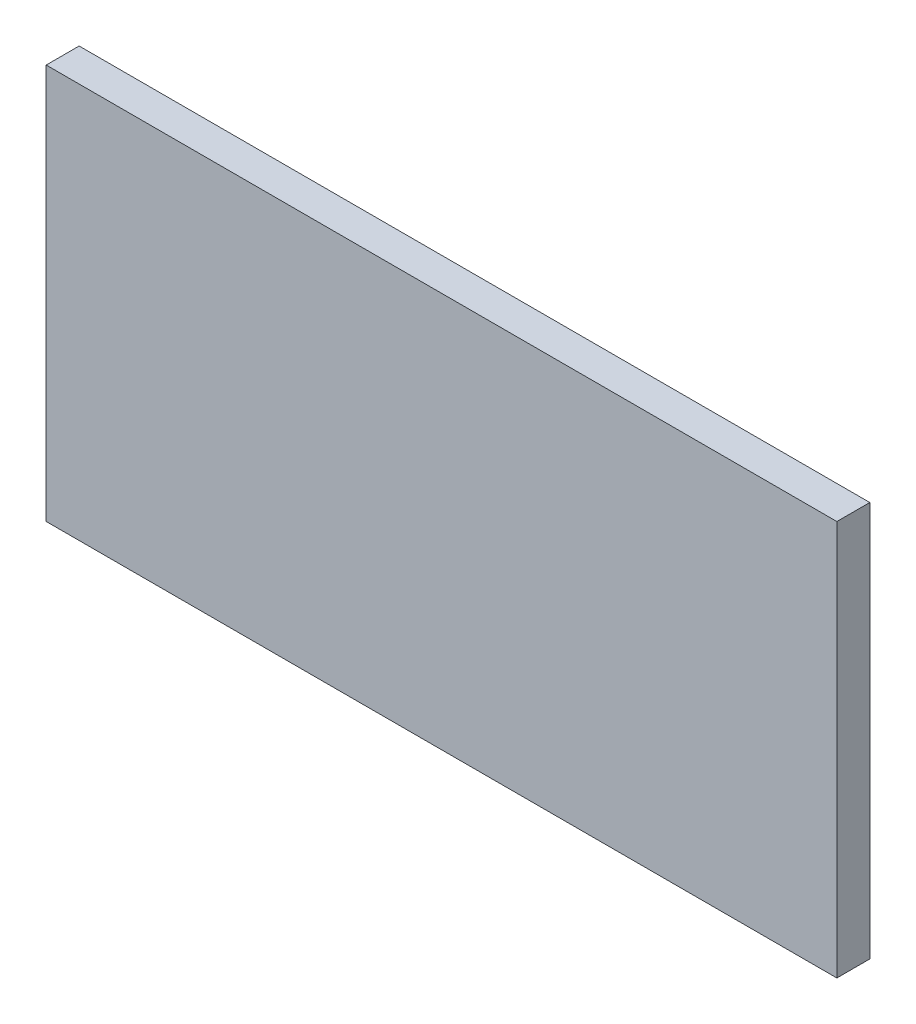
ISO-10303-21;
HEADER;
FILE_DESCRIPTION(('STEP AP214'),'2;1');
FILE_NAME('part.step','',(''),(''),'','','');
FILE_SCHEMA(('AUTOMOTIVE_DESIGN { 1 0 10303 214 1 1 1 1 }'));
ENDSEC;
DATA;
#1=APPLICATION_CONTEXT('core data for automotive mechanical design processes');
#2=APPLICATION_PROTOCOL_DEFINITION('international standard','automotive_design',2000,#1);
#3=PRODUCT_CONTEXT('',#1,'mechanical');
#4=PRODUCT('Part','Part','',(#3));
#5=PRODUCT_RELATED_PRODUCT_CATEGORY('part','',(#4));
#6=PRODUCT_DEFINITION_FORMATION('','',#4);
#7=PRODUCT_DEFINITION_CONTEXT('part definition',#1,'design');
#8=PRODUCT_DEFINITION('design','',#6,#7);
#9=PRODUCT_DEFINITION_SHAPE('','',#8);
#10=(LENGTH_UNIT() NAMED_UNIT(*) SI_UNIT(.MILLI.,.METRE.));
#11=(NAMED_UNIT(*) PLANE_ANGLE_UNIT() SI_UNIT($,.RADIAN.));
#12=(NAMED_UNIT(*) SI_UNIT($,.STERADIAN.) SOLID_ANGLE_UNIT());
#13=UNCERTAINTY_MEASURE_WITH_UNIT(LENGTH_MEASURE(1.E-05),#10,'distance_accuracy_value','');
#14=(GEOMETRIC_REPRESENTATION_CONTEXT(3) GLOBAL_UNCERTAINTY_ASSIGNED_CONTEXT((#13)) GLOBAL_UNIT_ASSIGNED_CONTEXT((#10,
#11,#12)) REPRESENTATION_CONTEXT('',''));
#15=CARTESIAN_POINT('',(0.,0.,0.));
#16=DIRECTION('',(0.,0.,1.));
#17=DIRECTION('',(1.,0.,0.));
#18=AXIS2_PLACEMENT_3D('',#15,#16,#17);
#19=CARTESIAN_POINT('',(0.,0.,5.));
#20=DIRECTION('',(1.,0.,0.));
#21=DIRECTION('',(0.,1.,0.));
#22=AXIS2_PLACEMENT_3D('',#19,#20,#21);
#23=PLANE('',#22);
#24=DIRECTION('',(0.,-1.,0.));
#25=VECTOR('',#24,1.);
#26=CARTESIAN_POINT('',(0.,0.,0.));
#27=LINE('',#26,#25);
#28=CARTESIAN_POINT('',(0.,0.,0.));
#29=VERTEX_POINT('',#28);
#30=CARTESIAN_POINT('',(0.,-60.,0.));
#31=VERTEX_POINT('',#30);
#32=EDGE_CURVE('E73',#29,#31,#27,.T.);
#33=ORIENTED_EDGE('',*,*,#32,.T.);
#34=DIRECTION('',(0.,0.,-1.));
#35=VECTOR('',#34,1.);
#36=CARTESIAN_POINT('',(0.,-60.,5.));
#37=LINE('',#36,#35);
#38=CARTESIAN_POINT('',(0.,-60.,5.));
#39=VERTEX_POINT('',#38);
#40=EDGE_CURVE('E11',#39,#31,#37,.T.);
#41=ORIENTED_EDGE('',*,*,#40,.F.);
#42=DIRECTION('',(0.,-1.,0.));
#43=VECTOR('',#42,1.);
#44=CARTESIAN_POINT('',(0.,0.,5.));
#45=LINE('',#44,#43);
#46=CARTESIAN_POINT('',(0.,0.,5.));
#47=VERTEX_POINT('',#46);
#48=EDGE_CURVE('E91',#47,#39,#45,.T.);
#49=ORIENTED_EDGE('',*,*,#48,.F.);
#50=DIRECTION('',(0.,0.,-1.));
#51=VECTOR('',#50,1.);
#52=CARTESIAN_POINT('',(0.,0.,5.));
#53=LINE('',#52,#51);
#54=EDGE_CURVE('E85',#47,#29,#53,.T.);
#55=ORIENTED_EDGE('',*,*,#54,.T.);
#56=EDGE_LOOP('',(#33,#41,#49,#55));
#57=FACE_BOUND('',#56,.T.);
#58=ADVANCED_FACE('F29',(#57),#23,.F.);
#59=CARTESIAN_POINT('',(0.,-60.,5.));
#60=DIRECTION('',(0.,1.,0.));
#61=DIRECTION('',(0.,0.,1.));
#62=AXIS2_PLACEMENT_3D('',#59,#60,#61);
#63=PLANE('',#62);
#64=DIRECTION('',(1.,0.,0.));
#65=VECTOR('',#64,1.);
#66=CARTESIAN_POINT('',(0.,-60.,0.));
#67=LINE('',#66,#65);
#68=CARTESIAN_POINT('',(120.,-60.,0.));
#69=VERTEX_POINT('',#68);
#70=EDGE_CURVE('E69',#31,#69,#67,.T.);
#71=ORIENTED_EDGE('',*,*,#70,.T.);
#72=DIRECTION('',(0.,0.,-1.));
#73=VECTOR('',#72,1.);
#74=CARTESIAN_POINT('',(120.,-60.,5.));
#75=LINE('',#74,#73);
#76=CARTESIAN_POINT('',(120.,-60.,5.));
#77=VERTEX_POINT('',#76);
#78=EDGE_CURVE('E36',#77,#69,#75,.T.);
#79=ORIENTED_EDGE('',*,*,#78,.F.);
#80=DIRECTION('',(1.,0.,0.));
#81=VECTOR('',#80,1.);
#82=CARTESIAN_POINT('',(0.,-60.,5.));
#83=LINE('',#82,#81);
#84=EDGE_CURVE('E81',#39,#77,#83,.T.);
#85=ORIENTED_EDGE('',*,*,#84,.F.);
#86=ORIENTED_EDGE('',*,*,#40,.T.);
#87=EDGE_LOOP('',(#71,#79,#85,#86));
#88=FACE_BOUND('',#87,.T.);
#89=ADVANCED_FACE('F80',(#88),#63,.F.);
#90=CARTESIAN_POINT('',(120.,0.,5.));
#91=DIRECTION('',(-1.,0.,0.));
#92=DIRECTION('',(0.,-1.,0.));
#93=AXIS2_PLACEMENT_3D('',#90,#91,#92);
#94=PLANE('',#93);
#95=DIRECTION('',(0.,1.,0.));
#96=VECTOR('',#95,1.);
#97=CARTESIAN_POINT('',(120.,0.,0.));
#98=LINE('',#97,#96);
#99=CARTESIAN_POINT('',(120.,0.,0.));
#100=VERTEX_POINT('',#99);
#101=EDGE_CURVE('E74',#69,#100,#98,.T.);
#102=ORIENTED_EDGE('',*,*,#101,.T.);
#103=DIRECTION('',(0.,0.,-1.));
#104=VECTOR('',#103,1.);
#105=CARTESIAN_POINT('',(120.,0.,5.));
#106=LINE('',#105,#104);
#107=CARTESIAN_POINT('',(120.,0.,5.));
#108=VERTEX_POINT('',#107);
#109=EDGE_CURVE('E97',#108,#100,#106,.T.);
#110=ORIENTED_EDGE('',*,*,#109,.F.);
#111=DIRECTION('',(0.,1.,0.));
#112=VECTOR('',#111,1.);
#113=CARTESIAN_POINT('',(120.,0.,5.));
#114=LINE('',#113,#112);
#115=EDGE_CURVE('E48',#77,#108,#114,.T.);
#116=ORIENTED_EDGE('',*,*,#115,.F.);
#117=ORIENTED_EDGE('',*,*,#78,.T.);
#118=EDGE_LOOP('',(#102,#110,#116,#117));
#119=FACE_BOUND('',#118,.T.);
#120=ADVANCED_FACE('F100',(#119),#94,.F.);
#121=CARTESIAN_POINT('',(0.,0.,5.));
#122=DIRECTION('',(0.,-1.,0.));
#123=DIRECTION('',(0.,0.,-1.));
#124=AXIS2_PLACEMENT_3D('',#121,#122,#123);
#125=PLANE('',#124);
#126=DIRECTION('',(-1.,0.,0.));
#127=VECTOR('',#126,1.);
#128=CARTESIAN_POINT('',(0.,0.,0.));
#129=LINE('',#128,#127);
#130=EDGE_CURVE('E89',#100,#29,#129,.T.);
#131=ORIENTED_EDGE('',*,*,#130,.T.);
#132=ORIENTED_EDGE('',*,*,#54,.F.);
#133=DIRECTION('',(-1.,0.,0.));
#134=VECTOR('',#133,1.);
#135=CARTESIAN_POINT('',(0.,0.,5.));
#136=LINE('',#135,#134);
#137=EDGE_CURVE('E43',#108,#47,#136,.T.);
#138=ORIENTED_EDGE('',*,*,#137,.F.);
#139=ORIENTED_EDGE('',*,*,#109,.T.);
#140=EDGE_LOOP('',(#131,#132,#138,#139));
#141=FACE_BOUND('',#140,.T.);
#142=ADVANCED_FACE('F102',(#141),#125,.F.);
#143=CARTESIAN_POINT('',(0.,-60.,5.));
#144=DIRECTION('',(0.,0.,1.));
#145=DIRECTION('',(1.,0.,0.));
#146=AXIS2_PLACEMENT_3D('',#143,#144,#145);
#147=PLANE('',#146);
#148=ORIENTED_EDGE('',*,*,#48,.T.);
#149=ORIENTED_EDGE('',*,*,#84,.T.);
#150=ORIENTED_EDGE('',*,*,#115,.T.);
#151=ORIENTED_EDGE('',*,*,#137,.T.);
#152=EDGE_LOOP('',(#148,#149,#150,#151));
#153=FACE_BOUND('',#152,.T.);
#154=ADVANCED_FACE('F103',(#153),#147,.T.);
#155=CARTESIAN_POINT('',(0.,-60.,0.));
#156=DIRECTION('',(0.,0.,1.));
#157=DIRECTION('',(1.,0.,0.));
#158=AXIS2_PLACEMENT_3D('',#155,#156,#157);
#159=PLANE('',#158);
#160=ORIENTED_EDGE('',*,*,#32,.F.);
#161=ORIENTED_EDGE('',*,*,#130,.F.);
#162=ORIENTED_EDGE('',*,*,#101,.F.);
#163=ORIENTED_EDGE('',*,*,#70,.F.);
#164=EDGE_LOOP('',(#160,#161,#162,#163));
#165=FACE_BOUND('',#164,.T.);
#166=ADVANCED_FACE('F70',(#165),#159,.F.);
#167=CLOSED_SHELL('',(#58,#89,#120,#142,#154,#166));
#168=MANIFOLD_SOLID_BREP('B2',#167);
#169=ADVANCED_BREP_SHAPE_REPRESENTATION('',(#18,#168),#14);
#170=SHAPE_DEFINITION_REPRESENTATION(#9,#169);
ENDSEC;
END-ISO-10303-21;
